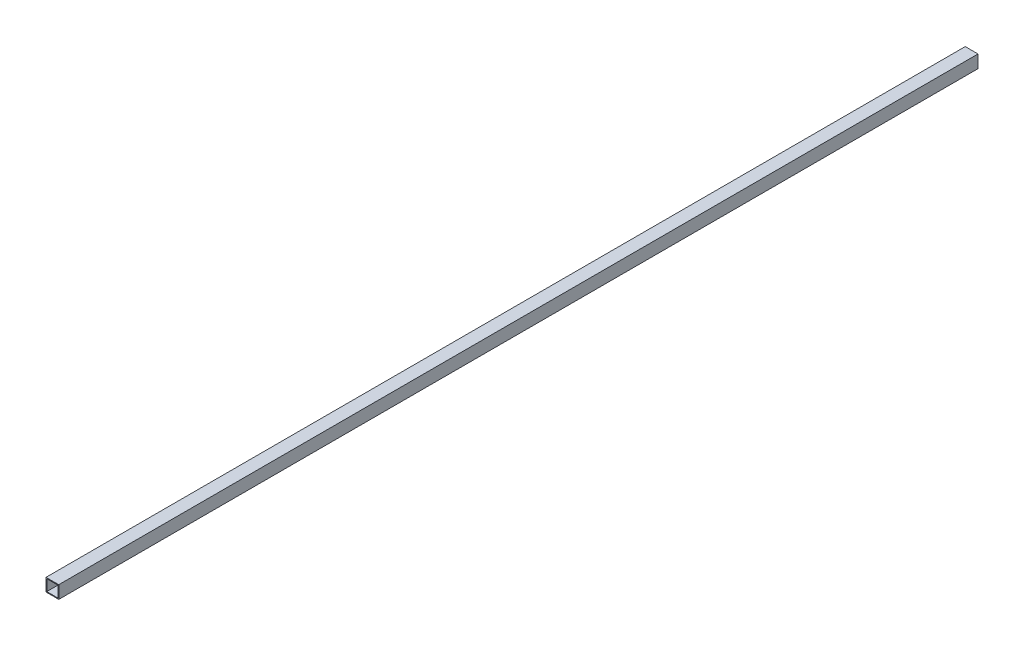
ISO-10303-21;
HEADER;
FILE_DESCRIPTION(('STEP AP214'),'2;1');
FILE_NAME('part.step','',(''),(''),'','','');
FILE_SCHEMA(('AUTOMOTIVE_DESIGN { 1 0 10303 214 1 1 1 1 }'));
ENDSEC;
DATA;
#1=APPLICATION_CONTEXT('core data for automotive mechanical design processes');
#2=APPLICATION_PROTOCOL_DEFINITION('international standard','automotive_design',2000,#1);
#3=PRODUCT_CONTEXT('',#1,'mechanical');
#4=PRODUCT('Part','Part','',(#3));
#5=PRODUCT_RELATED_PRODUCT_CATEGORY('part','',(#4));
#6=PRODUCT_DEFINITION_FORMATION('','',#4);
#7=PRODUCT_DEFINITION_CONTEXT('part definition',#1,'design');
#8=PRODUCT_DEFINITION('design','',#6,#7);
#9=PRODUCT_DEFINITION_SHAPE('','',#8);
#10=(LENGTH_UNIT() NAMED_UNIT(*) SI_UNIT(.MILLI.,.METRE.));
#11=(NAMED_UNIT(*) PLANE_ANGLE_UNIT() SI_UNIT($,.RADIAN.));
#12=(NAMED_UNIT(*) SI_UNIT($,.STERADIAN.) SOLID_ANGLE_UNIT());
#13=UNCERTAINTY_MEASURE_WITH_UNIT(LENGTH_MEASURE(1.E-05),#10,'distance_accuracy_value','');
#14=(GEOMETRIC_REPRESENTATION_CONTEXT(3) GLOBAL_UNCERTAINTY_ASSIGNED_CONTEXT((#13)) GLOBAL_UNIT_ASSIGNED_CONTEXT((#10,
#11,#12)) REPRESENTATION_CONTEXT('',''));
#15=CARTESIAN_POINT('',(0.,0.,0.));
#16=DIRECTION('',(0.,0.,1.));
#17=DIRECTION('',(1.,0.,0.));
#18=AXIS2_PLACEMENT_3D('',#15,#16,#17);
#19=CARTESIAN_POINT('',(-25.4,-25.4,0.));
#20=DIRECTION('',(0.,-1.,0.));
#21=DIRECTION('',(0.,0.,-1.));
#22=AXIS2_PLACEMENT_3D('',#19,#20,#21);
#23=PLANE('',#22);
#24=DIRECTION('',(1.,0.,0.));
#25=VECTOR('',#24,1.);
#26=CARTESIAN_POINT('',(-25.4,-25.4,3657.6));
#27=LINE('',#26,#25);
#28=CARTESIAN_POINT('',(-25.4,-25.4,3657.6));
#29=VERTEX_POINT('',#28);
#30=CARTESIAN_POINT('',(25.4,-25.4,3657.6));
#31=VERTEX_POINT('',#30);
#32=EDGE_CURVE('E129',#29,#31,#27,.T.);
#33=ORIENTED_EDGE('',*,*,#32,.F.);
#34=DIRECTION('',(0.,0.,1.));
#35=VECTOR('',#34,1.);
#36=CARTESIAN_POINT('',(-25.4,-25.4,0.));
#37=LINE('',#36,#35);
#38=CARTESIAN_POINT('',(-25.4,-25.4,0.));
#39=VERTEX_POINT('',#38);
#40=EDGE_CURVE('E11',#39,#29,#37,.T.);
#41=ORIENTED_EDGE('',*,*,#40,.F.);
#42=DIRECTION('',(1.,0.,0.));
#43=VECTOR('',#42,1.);
#44=CARTESIAN_POINT('',(-25.4,-25.4,0.));
#45=LINE('',#44,#43);
#46=CARTESIAN_POINT('',(25.4,-25.4,0.));
#47=VERTEX_POINT('',#46);
#48=EDGE_CURVE('E133',#39,#47,#45,.T.);
#49=ORIENTED_EDGE('',*,*,#48,.T.);
#50=DIRECTION('',(0.,0.,1.));
#51=VECTOR('',#50,1.);
#52=CARTESIAN_POINT('',(25.4,-25.4,0.));
#53=LINE('',#52,#51);
#54=EDGE_CURVE('E34',#47,#31,#53,.T.);
#55=ORIENTED_EDGE('',*,*,#54,.T.);
#56=EDGE_LOOP('',(#33,#41,#49,#55));
#57=FACE_BOUND('',#56,.T.);
#58=ADVANCED_FACE('F31',(#57),#23,.T.);
#59=CARTESIAN_POINT('',(-25.4,25.4,0.));
#60=DIRECTION('',(-1.,0.,0.));
#61=DIRECTION('',(0.,0.,1.));
#62=AXIS2_PLACEMENT_3D('',#59,#60,#61);
#63=PLANE('',#62);
#64=DIRECTION('',(0.,-1.,0.));
#65=VECTOR('',#64,1.);
#66=CARTESIAN_POINT('',(-25.4,25.4,3657.6));
#67=LINE('',#66,#65);
#68=CARTESIAN_POINT('',(-25.4,25.4,3657.6));
#69=VERTEX_POINT('',#68);
#70=EDGE_CURVE('E137',#69,#29,#67,.T.);
#71=ORIENTED_EDGE('',*,*,#70,.F.);
#72=DIRECTION('',(0.,0.,1.));
#73=VECTOR('',#72,1.);
#74=CARTESIAN_POINT('',(-25.4,25.4,0.));
#75=LINE('',#74,#73);
#76=CARTESIAN_POINT('',(-25.4,25.4,0.));
#77=VERTEX_POINT('',#76);
#78=EDGE_CURVE('E39',#77,#69,#75,.T.);
#79=ORIENTED_EDGE('',*,*,#78,.F.);
#80=DIRECTION('',(0.,-1.,0.));
#81=VECTOR('',#80,1.);
#82=CARTESIAN_POINT('',(-25.4,25.4,0.));
#83=LINE('',#82,#81);
#84=EDGE_CURVE('E143',#77,#39,#83,.T.);
#85=ORIENTED_EDGE('',*,*,#84,.T.);
#86=ORIENTED_EDGE('',*,*,#40,.T.);
#87=EDGE_LOOP('',(#71,#79,#85,#86));
#88=FACE_BOUND('',#87,.T.);
#89=ADVANCED_FACE('F169',(#88),#63,.T.);
#90=CARTESIAN_POINT('',(25.4,25.4,0.));
#91=DIRECTION('',(0.,1.,0.));
#92=DIRECTION('',(0.,0.,1.));
#93=AXIS2_PLACEMENT_3D('',#90,#91,#92);
#94=PLANE('',#93);
#95=DIRECTION('',(-1.,0.,0.));
#96=VECTOR('',#95,1.);
#97=CARTESIAN_POINT('',(25.4,25.4,3657.6));
#98=LINE('',#97,#96);
#99=CARTESIAN_POINT('',(25.4,25.4,3657.6));
#100=VERTEX_POINT('',#99);
#101=EDGE_CURVE('E151',#100,#69,#98,.T.);
#102=ORIENTED_EDGE('',*,*,#101,.F.);
#103=DIRECTION('',(0.,0.,1.));
#104=VECTOR('',#103,1.);
#105=CARTESIAN_POINT('',(25.4,25.4,0.));
#106=LINE('',#105,#104);
#107=CARTESIAN_POINT('',(25.4,25.4,0.));
#108=VERTEX_POINT('',#107);
#109=EDGE_CURVE('E156',#108,#100,#106,.T.);
#110=ORIENTED_EDGE('',*,*,#109,.F.);
#111=DIRECTION('',(-1.,0.,0.));
#112=VECTOR('',#111,1.);
#113=CARTESIAN_POINT('',(25.4,25.4,0.));
#114=LINE('',#113,#112);
#115=EDGE_CURVE('E140',#108,#77,#114,.T.);
#116=ORIENTED_EDGE('',*,*,#115,.T.);
#117=ORIENTED_EDGE('',*,*,#78,.T.);
#118=EDGE_LOOP('',(#102,#110,#116,#117));
#119=FACE_BOUND('',#118,.T.);
#120=ADVANCED_FACE('F173',(#119),#94,.T.);
#121=CARTESIAN_POINT('',(25.4,-25.4,0.));
#122=DIRECTION('',(1.,0.,0.));
#123=DIRECTION('',(0.,0.,-1.));
#124=AXIS2_PLACEMENT_3D('',#121,#122,#123);
#125=PLANE('',#124);
#126=DIRECTION('',(0.,1.,0.));
#127=VECTOR('',#126,1.);
#128=CARTESIAN_POINT('',(25.4,-25.4,3657.6));
#129=LINE('',#128,#127);
#130=EDGE_CURVE('E148',#31,#100,#129,.T.);
#131=ORIENTED_EDGE('',*,*,#130,.F.);
#132=ORIENTED_EDGE('',*,*,#54,.F.);
#133=DIRECTION('',(0.,1.,0.));
#134=VECTOR('',#133,1.);
#135=CARTESIAN_POINT('',(25.4,-25.4,0.));
#136=LINE('',#135,#134);
#137=EDGE_CURVE('E136',#47,#108,#136,.T.);
#138=ORIENTED_EDGE('',*,*,#137,.T.);
#139=ORIENTED_EDGE('',*,*,#109,.T.);
#140=EDGE_LOOP('',(#131,#132,#138,#139));
#141=FACE_BOUND('',#140,.T.);
#142=ADVANCED_FACE('F164',(#141),#125,.T.);
#143=CARTESIAN_POINT('',(25.4,-25.4,0.));
#144=DIRECTION('',(0.,0.,1.));
#145=DIRECTION('',(1.,0.,0.));
#146=AXIS2_PLACEMENT_3D('',#143,#144,#145);
#147=PLANE('',#146);
#148=DIRECTION('',(0.,1.,0.));
#149=VECTOR('',#148,1.);
#150=CARTESIAN_POINT('',(22.225,22.225,0.));
#151=LINE('',#150,#149);
#152=CARTESIAN_POINT('',(22.225,-22.225,0.));
#153=VERTEX_POINT('',#152);
#154=CARTESIAN_POINT('',(22.225,22.225,0.));
#155=VERTEX_POINT('',#154);
#156=EDGE_CURVE('E104',#153,#155,#151,.T.);
#157=ORIENTED_EDGE('',*,*,#156,.T.);
#158=DIRECTION('',(-1.,0.,0.));
#159=VECTOR('',#158,1.);
#160=CARTESIAN_POINT('',(-22.225,22.225,0.));
#161=LINE('',#160,#159);
#162=CARTESIAN_POINT('',(-22.225,22.225,0.));
#163=VERTEX_POINT('',#162);
#164=EDGE_CURVE('E98',#155,#163,#161,.T.);
#165=ORIENTED_EDGE('',*,*,#164,.T.);
#166=DIRECTION('',(0.,-1.,0.));
#167=VECTOR('',#166,1.);
#168=CARTESIAN_POINT('',(-22.225,-22.225,0.));
#169=LINE('',#168,#167);
#170=CARTESIAN_POINT('',(-22.225,-22.225,0.));
#171=VERTEX_POINT('',#170);
#172=EDGE_CURVE('E107',#163,#171,#169,.T.);
#173=ORIENTED_EDGE('',*,*,#172,.T.);
#174=DIRECTION('',(1.,0.,0.));
#175=VECTOR('',#174,1.);
#176=CARTESIAN_POINT('',(22.225,-22.225,0.));
#177=LINE('',#176,#175);
#178=EDGE_CURVE('E47',#171,#153,#177,.T.);
#179=ORIENTED_EDGE('',*,*,#178,.T.);
#180=EDGE_LOOP('',(#157,#165,#173,#179));
#181=FACE_BOUND('',#180,.T.);
#182=ORIENTED_EDGE('',*,*,#48,.F.);
#183=ORIENTED_EDGE('',*,*,#84,.F.);
#184=ORIENTED_EDGE('',*,*,#115,.F.);
#185=ORIENTED_EDGE('',*,*,#137,.F.);
#186=EDGE_LOOP('',(#182,#183,#184,#185));
#187=FACE_BOUND('',#186,.T.);
#188=ADVANCED_FACE('F111',(#181,#187),#147,.F.);
#189=CARTESIAN_POINT('',(25.4,-25.4,3657.6));
#190=DIRECTION('',(0.,0.,1.));
#191=DIRECTION('',(1.,0.,0.));
#192=AXIS2_PLACEMENT_3D('',#189,#190,#191);
#193=PLANE('',#192);
#194=DIRECTION('',(-1.,0.,0.));
#195=VECTOR('',#194,1.);
#196=CARTESIAN_POINT('',(-22.225,22.225,3657.6));
#197=LINE('',#196,#195);
#198=CARTESIAN_POINT('',(22.225,22.225,3657.6));
#199=VERTEX_POINT('',#198);
#200=CARTESIAN_POINT('',(-22.225,22.225,3657.6));
#201=VERTEX_POINT('',#200);
#202=EDGE_CURVE('E55',#199,#201,#197,.T.);
#203=ORIENTED_EDGE('',*,*,#202,.F.);
#204=DIRECTION('',(0.,1.,0.));
#205=VECTOR('',#204,1.);
#206=CARTESIAN_POINT('',(22.225,22.225,3657.6));
#207=LINE('',#206,#205);
#208=CARTESIAN_POINT('',(22.225,-22.225,3657.6));
#209=VERTEX_POINT('',#208);
#210=EDGE_CURVE('E114',#209,#199,#207,.T.);
#211=ORIENTED_EDGE('',*,*,#210,.F.);
#212=DIRECTION('',(1.,0.,0.));
#213=VECTOR('',#212,1.);
#214=CARTESIAN_POINT('',(22.225,-22.225,3657.6));
#215=LINE('',#214,#213);
#216=CARTESIAN_POINT('',(-22.225,-22.225,3657.6));
#217=VERTEX_POINT('',#216);
#218=EDGE_CURVE('E117',#217,#209,#215,.T.);
#219=ORIENTED_EDGE('',*,*,#218,.F.);
#220=DIRECTION('',(0.,-1.,0.));
#221=VECTOR('',#220,1.);
#222=CARTESIAN_POINT('',(-22.225,-22.225,3657.6));
#223=LINE('',#222,#221);
#224=EDGE_CURVE('E123',#201,#217,#223,.T.);
#225=ORIENTED_EDGE('',*,*,#224,.F.);
#226=EDGE_LOOP('',(#203,#211,#219,#225));
#227=FACE_BOUND('',#226,.T.);
#228=ORIENTED_EDGE('',*,*,#32,.T.);
#229=ORIENTED_EDGE('',*,*,#130,.T.);
#230=ORIENTED_EDGE('',*,*,#101,.T.);
#231=ORIENTED_EDGE('',*,*,#70,.T.);
#232=EDGE_LOOP('',(#228,#229,#230,#231));
#233=FACE_BOUND('',#232,.T.);
#234=ADVANCED_FACE('F166',(#227,#233),#193,.T.);
#235=CARTESIAN_POINT('',(-22.225,22.225,0.));
#236=DIRECTION('',(0.,1.,0.));
#237=DIRECTION('',(0.,0.,1.));
#238=AXIS2_PLACEMENT_3D('',#235,#236,#237);
#239=PLANE('',#238);
#240=ORIENTED_EDGE('',*,*,#202,.T.);
#241=DIRECTION('',(0.,0.,1.));
#242=VECTOR('',#241,1.);
#243=CARTESIAN_POINT('',(-22.225,22.225,0.));
#244=LINE('',#243,#242);
#245=EDGE_CURVE('E94',#163,#201,#244,.T.);
#246=ORIENTED_EDGE('',*,*,#245,.F.);
#247=ORIENTED_EDGE('',*,*,#164,.F.);
#248=DIRECTION('',(0.,0.,1.));
#249=VECTOR('',#248,1.);
#250=CARTESIAN_POINT('',(22.225,22.225,0.));
#251=LINE('',#250,#249);
#252=EDGE_CURVE('E127',#155,#199,#251,.T.);
#253=ORIENTED_EDGE('',*,*,#252,.T.);
#254=EDGE_LOOP('',(#240,#246,#247,#253));
#255=FACE_BOUND('',#254,.T.);
#256=ADVANCED_FACE('F96',(#255),#239,.F.);
#257=CARTESIAN_POINT('',(22.225,22.225,0.));
#258=DIRECTION('',(1.,0.,0.));
#259=DIRECTION('',(0.,0.,-1.));
#260=AXIS2_PLACEMENT_3D('',#257,#258,#259);
#261=PLANE('',#260);
#262=ORIENTED_EDGE('',*,*,#210,.T.);
#263=ORIENTED_EDGE('',*,*,#252,.F.);
#264=ORIENTED_EDGE('',*,*,#156,.F.);
#265=DIRECTION('',(0.,0.,1.));
#266=VECTOR('',#265,1.);
#267=CARTESIAN_POINT('',(22.225,-22.225,0.));
#268=LINE('',#267,#266);
#269=EDGE_CURVE('E130',#153,#209,#268,.T.);
#270=ORIENTED_EDGE('',*,*,#269,.T.);
#271=EDGE_LOOP('',(#262,#263,#264,#270));
#272=FACE_BOUND('',#271,.T.);
#273=ADVANCED_FACE('F224',(#272),#261,.F.);
#274=CARTESIAN_POINT('',(22.225,-22.225,0.));
#275=DIRECTION('',(0.,-1.,0.));
#276=DIRECTION('',(0.,0.,-1.));
#277=AXIS2_PLACEMENT_3D('',#274,#275,#276);
#278=PLANE('',#277);
#279=ORIENTED_EDGE('',*,*,#218,.T.);
#280=ORIENTED_EDGE('',*,*,#269,.F.);
#281=ORIENTED_EDGE('',*,*,#178,.F.);
#282=DIRECTION('',(0.,0.,1.));
#283=VECTOR('',#282,1.);
#284=CARTESIAN_POINT('',(-22.225,-22.225,0.));
#285=LINE('',#284,#283);
#286=EDGE_CURVE('E103',#171,#217,#285,.T.);
#287=ORIENTED_EDGE('',*,*,#286,.T.);
#288=EDGE_LOOP('',(#279,#280,#281,#287));
#289=FACE_BOUND('',#288,.T.);
#290=ADVANCED_FACE('F233',(#289),#278,.F.);
#291=CARTESIAN_POINT('',(-22.225,-22.225,0.));
#292=DIRECTION('',(-1.,0.,0.));
#293=DIRECTION('',(0.,0.,1.));
#294=AXIS2_PLACEMENT_3D('',#291,#292,#293);
#295=PLANE('',#294);
#296=ORIENTED_EDGE('',*,*,#224,.T.);
#297=ORIENTED_EDGE('',*,*,#286,.F.);
#298=ORIENTED_EDGE('',*,*,#172,.F.);
#299=ORIENTED_EDGE('',*,*,#245,.T.);
#300=EDGE_LOOP('',(#296,#297,#298,#299));
#301=FACE_BOUND('',#300,.T.);
#302=ADVANCED_FACE('F108',(#301),#295,.F.);
#303=CLOSED_SHELL('',(#58,#89,#120,#142,#188,#234,#256,#273,#290,#302));
#304=MANIFOLD_SOLID_BREP('B2',#303);
#305=ADVANCED_BREP_SHAPE_REPRESENTATION('',(#18,#304),#14);
#306=SHAPE_DEFINITION_REPRESENTATION(#9,#305);
ENDSEC;
END-ISO-10303-21;
